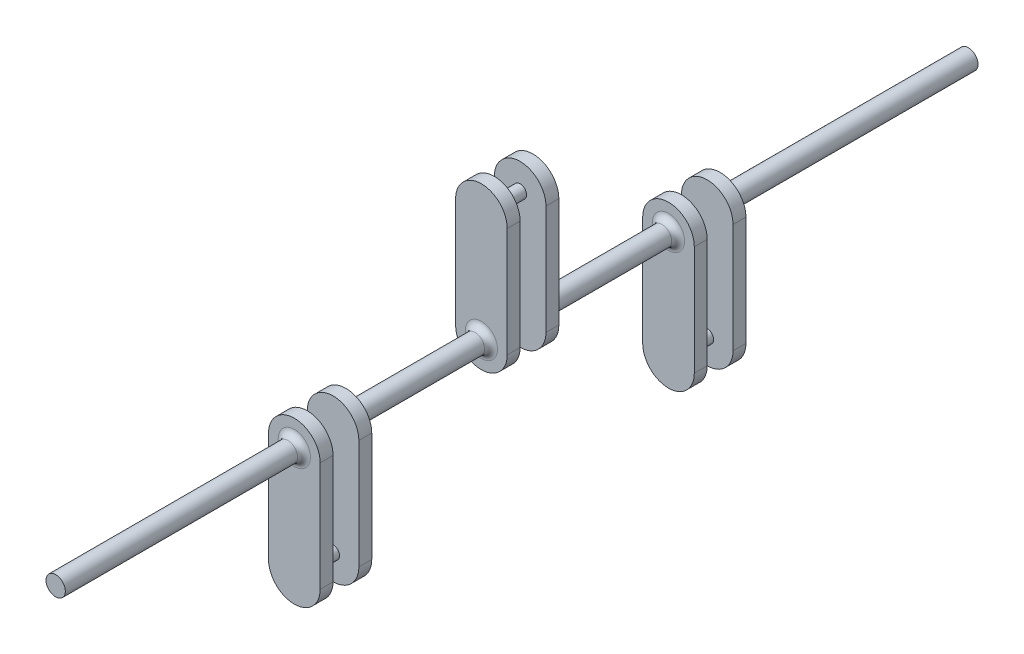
ISO-10303-21;
HEADER;
FILE_DESCRIPTION(('STEP AP214'),'2;1');
FILE_NAME('part.step','',(''),(''),'','','');
FILE_SCHEMA(('AUTOMOTIVE_DESIGN { 1 0 10303 214 1 1 1 1 }'));
ENDSEC;
DATA;
#1=APPLICATION_CONTEXT('core data for automotive mechanical design processes');
#2=APPLICATION_PROTOCOL_DEFINITION('international standard','automotive_design',2000,#1);
#3=PRODUCT_CONTEXT('',#1,'mechanical');
#4=PRODUCT('Part','Part','',(#3));
#5=PRODUCT_RELATED_PRODUCT_CATEGORY('part','',(#4));
#6=PRODUCT_DEFINITION_FORMATION('','',#4);
#7=PRODUCT_DEFINITION_CONTEXT('part definition',#1,'design');
#8=PRODUCT_DEFINITION('design','',#6,#7);
#9=PRODUCT_DEFINITION_SHAPE('','',#8);
#10=(LENGTH_UNIT() NAMED_UNIT(*) SI_UNIT(.MILLI.,.METRE.));
#11=(NAMED_UNIT(*) PLANE_ANGLE_UNIT() SI_UNIT($,.RADIAN.));
#12=(NAMED_UNIT(*) SI_UNIT($,.STERADIAN.) SOLID_ANGLE_UNIT());
#13=UNCERTAINTY_MEASURE_WITH_UNIT(LENGTH_MEASURE(1.E-05),#10,'distance_accuracy_value','');
#14=(GEOMETRIC_REPRESENTATION_CONTEXT(3) GLOBAL_UNCERTAINTY_ASSIGNED_CONTEXT((#13)) GLOBAL_UNIT_ASSIGNED_CONTEXT((#10,
#11,#12)) REPRESENTATION_CONTEXT('',''));
#15=CARTESIAN_POINT('',(0.,0.,0.));
#16=DIRECTION('',(0.,0.,1.));
#17=DIRECTION('',(1.,0.,0.));
#18=AXIS2_PLACEMENT_3D('',#15,#16,#17);
#19=CARTESIAN_POINT('',(-25.4,-1.76662079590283E-13,342.9));
#20=DIRECTION('',(1.,0.,0.));
#21=DIRECTION('',(0.,1.,0.));
#22=AXIS2_PLACEMENT_3D('',#19,#20,#21);
#23=PLANE('',#22);
#24=DIRECTION('',(0.,-1.,0.));
#25=VECTOR('',#24,1.);
#26=CARTESIAN_POINT('',(-25.4,-1.76662079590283E-13,330.2));
#27=LINE('',#26,#25);
#28=CARTESIAN_POINT('',(-25.4000000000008,107.7468,330.2));
#29=VERTEX_POINT('',#28);
#30=CARTESIAN_POINT('',(-25.4,-1.77367247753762E-13,330.2));
#31=VERTEX_POINT('',#30);
#32=EDGE_CURVE('E223',#29,#31,#27,.T.);
#33=ORIENTED_EDGE('',*,*,#32,.T.);
#34=DIRECTION('',(0.,0.,-1.));
#35=VECTOR('',#34,1.);
#36=CARTESIAN_POINT('',(-25.4,-1.77367247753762E-13,342.9));
#37=LINE('',#36,#35);
#38=CARTESIAN_POINT('',(-25.4,-1.77367247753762E-13,342.9));
#39=VERTEX_POINT('',#38);
#40=EDGE_CURVE('E286',#39,#31,#37,.T.);
#41=ORIENTED_EDGE('',*,*,#40,.F.);
#42=DIRECTION('',(0.,-1.,0.));
#43=VECTOR('',#42,1.);
#44=CARTESIAN_POINT('',(-25.4,-1.76662079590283E-13,342.9));
#45=LINE('',#44,#43);
#46=CARTESIAN_POINT('',(-25.4000000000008,107.7468,342.9));
#47=VERTEX_POINT('',#46);
#48=EDGE_CURVE('E259',#47,#39,#45,.T.);
#49=ORIENTED_EDGE('',*,*,#48,.F.);
#50=DIRECTION('',(0.,0.,-1.));
#51=VECTOR('',#50,1.);
#52=CARTESIAN_POINT('',(-25.4000000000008,107.7468,342.9));
#53=LINE('',#52,#51);
#54=EDGE_CURVE('E270',#47,#29,#53,.T.);
#55=ORIENTED_EDGE('',*,*,#54,.T.);
#56=EDGE_LOOP('',(#33,#41,#49,#55));
#57=FACE_BOUND('',#56,.T.);
#58=ADVANCED_FACE('F41',(#57),#23,.F.);
#59=CARTESIAN_POINT('',(0.,0.,342.9));
#60=DIRECTION('',(0.,0.,-1.));
#61=DIRECTION('',(-1.,0.,0.));
#62=AXIS2_PLACEMENT_3D('',#59,#60,#61);
#63=CYLINDRICAL_SURFACE('',#62,25.4);
#64=CARTESIAN_POINT('',(0.,0.,330.2));
#65=DIRECTION('',(0.,0.,1.));
#66=DIRECTION('',(1.,0.,0.));
#67=AXIS2_PLACEMENT_3D('',#64,#65,#66);
#68=CIRCLE('',#67,25.4);
#69=CARTESIAN_POINT('',(25.4,1.77367248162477E-13,330.2));
#70=VERTEX_POINT('',#69);
#71=EDGE_CURVE('E273',#31,#70,#68,.T.);
#72=ORIENTED_EDGE('',*,*,#71,.T.);
#73=DIRECTION('',(0.,0.,-1.));
#74=VECTOR('',#73,1.);
#75=CARTESIAN_POINT('',(25.4,1.77367248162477E-13,342.9));
#76=LINE('',#75,#74);
#77=CARTESIAN_POINT('',(25.4,1.77367248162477E-13,342.9));
#78=VERTEX_POINT('',#77);
#79=EDGE_CURVE('E284',#78,#70,#76,.T.);
#80=ORIENTED_EDGE('',*,*,#79,.F.);
#81=CARTESIAN_POINT('',(0.,0.,342.9));
#82=DIRECTION('',(0.,0.,1.));
#83=DIRECTION('',(1.,0.,0.));
#84=AXIS2_PLACEMENT_3D('',#81,#82,#83);
#85=CIRCLE('',#84,25.4);
#86=EDGE_CURVE('E262',#39,#78,#85,.T.);
#87=ORIENTED_EDGE('',*,*,#86,.F.);
#88=ORIENTED_EDGE('',*,*,#40,.T.);
#89=EDGE_LOOP('',(#72,#80,#87,#88));
#90=FACE_BOUND('',#89,.T.);
#91=ADVANCED_FACE('F476',(#90),#63,.T.);
#92=CARTESIAN_POINT('',(25.4,1.78297839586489E-13,342.9));
#93=DIRECTION('',(1.,0.,0.));
#94=DIRECTION('',(0.,1.,0.));
#95=AXIS2_PLACEMENT_3D('',#92,#93,#94);
#96=PLANE('',#95);
#97=DIRECTION('',(0.,-1.,0.));
#98=VECTOR('',#97,1.);
#99=CARTESIAN_POINT('',(25.4,1.78297839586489E-13,330.2));
#100=LINE('',#99,#98);
#101=CARTESIAN_POINT('',(25.3999999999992,107.7468,330.2));
#102=VERTEX_POINT('',#101);
#103=EDGE_CURVE('E276',#102,#70,#100,.T.);
#104=ORIENTED_EDGE('',*,*,#103,.F.);
#105=DIRECTION('',(0.,0.,-1.));
#106=VECTOR('',#105,1.);
#107=CARTESIAN_POINT('',(25.3999999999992,107.7468,342.9));
#108=LINE('',#107,#106);
#109=CARTESIAN_POINT('',(25.3999999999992,107.7468,342.9));
#110=VERTEX_POINT('',#109);
#111=EDGE_CURVE('E282',#110,#102,#108,.T.);
#112=ORIENTED_EDGE('',*,*,#111,.F.);
#113=DIRECTION('',(0.,-1.,0.));
#114=VECTOR('',#113,1.);
#115=CARTESIAN_POINT('',(25.4,1.78297839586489E-13,342.9));
#116=LINE('',#115,#114);
#117=EDGE_CURVE('E265',#110,#78,#116,.T.);
#118=ORIENTED_EDGE('',*,*,#117,.T.);
#119=ORIENTED_EDGE('',*,*,#79,.T.);
#120=EDGE_LOOP('',(#104,#112,#118,#119));
#121=FACE_BOUND('',#120,.T.);
#122=ADVANCED_FACE('F483',(#121),#96,.T.);
#123=CARTESIAN_POINT('',(-7.52391883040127E-13,107.7468,342.9));
#124=DIRECTION('',(0.,0.,-1.));
#125=DIRECTION('',(-1.,0.,0.));
#126=AXIS2_PLACEMENT_3D('',#123,#124,#125);
#127=CYLINDRICAL_SURFACE('',#126,25.4);
#128=CARTESIAN_POINT('',(-7.52391883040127E-13,107.7468,330.2));
#129=DIRECTION('',(0.,0.,1.));
#130=DIRECTION('',(1.,0.,0.));
#131=AXIS2_PLACEMENT_3D('',#128,#129,#130);
#132=CIRCLE('',#131,25.4);
#133=EDGE_CURVE('E263',#102,#29,#132,.T.);
#134=ORIENTED_EDGE('',*,*,#133,.T.);
#135=ORIENTED_EDGE('',*,*,#54,.F.);
#136=CARTESIAN_POINT('',(-7.52391883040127E-13,107.7468,342.9));
#137=DIRECTION('',(0.,0.,1.));
#138=DIRECTION('',(1.,0.,0.));
#139=AXIS2_PLACEMENT_3D('',#136,#137,#138);
#140=CIRCLE('',#139,25.4);
#141=EDGE_CURVE('E268',#110,#47,#140,.T.);
#142=ORIENTED_EDGE('',*,*,#141,.F.);
#143=ORIENTED_EDGE('',*,*,#111,.T.);
#144=EDGE_LOOP('',(#134,#135,#142,#143));
#145=FACE_BOUND('',#144,.T.);
#146=ADVANCED_FACE('F659',(#145),#127,.T.);
#147=CARTESIAN_POINT('',(0.,0.,342.9));
#148=DIRECTION('',(0.,0.,1.));
#149=DIRECTION('',(1.,0.,0.));
#150=AXIS2_PLACEMENT_3D('',#147,#148,#149);
#151=PLANE('',#150);
#152=CARTESIAN_POINT('',(0.,0.,342.9));
#153=DIRECTION('',(0.,0.,1.));
#154=DIRECTION('',(1.,0.,0.));
#155=AXIS2_PLACEMENT_3D('',#152,#153,#154);
#156=CIRCLE('',#155,15.875);
#157=CARTESIAN_POINT('',(15.875,0.,342.9));
#158=VERTEX_POINT('',#157);
#159=EDGE_CURVE('E453',#158,#158,#156,.F.);
#160=ORIENTED_EDGE('',*,*,#159,.T.);
#161=EDGE_LOOP('',(#160));
#162=FACE_BOUND('',#161,.T.);
#163=ORIENTED_EDGE('',*,*,#48,.T.);
#164=ORIENTED_EDGE('',*,*,#86,.T.);
#165=ORIENTED_EDGE('',*,*,#117,.F.);
#166=ORIENTED_EDGE('',*,*,#141,.T.);
#167=EDGE_LOOP('',(#163,#164,#165,#166));
#168=FACE_BOUND('',#167,.T.);
#169=ADVANCED_FACE('F656',(#162,#168),#151,.T.);
#170=CARTESIAN_POINT('',(0.,0.,330.2));
#171=DIRECTION('',(0.,0.,1.));
#172=DIRECTION('',(1.,0.,0.));
#173=AXIS2_PLACEMENT_3D('',#170,#171,#172);
#174=PLANE('',#173);
#175=CARTESIAN_POINT('',(-7.52391883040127E-13,107.7468,330.2));
#176=DIRECTION('',(0.,0.,1.));
#177=DIRECTION('',(1.,0.,0.));
#178=AXIS2_PLACEMENT_3D('',#175,#176,#177);
#179=CIRCLE('',#178,6.35000000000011);
#180=CARTESIAN_POINT('',(6.34999999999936,107.7468,330.2));
#181=VERTEX_POINT('',#180);
#182=EDGE_CURVE('E246',#181,#181,#179,.T.);
#183=ORIENTED_EDGE('',*,*,#182,.T.);
#184=EDGE_LOOP('',(#183));
#185=FACE_BOUND('',#184,.T.);
#186=ORIENTED_EDGE('',*,*,#32,.F.);
#187=ORIENTED_EDGE('',*,*,#133,.F.);
#188=ORIENTED_EDGE('',*,*,#103,.T.);
#189=ORIENTED_EDGE('',*,*,#71,.F.);
#190=EDGE_LOOP('',(#186,#187,#188,#189));
#191=FACE_BOUND('',#190,.T.);
#192=ADVANCED_FACE('F594',(#185,#191),#174,.F.);
#193=CARTESIAN_POINT('',(0.,0.,762.));
#194=DIRECTION('',(0.,0.,1.));
#195=DIRECTION('',(1.,0.,0.));
#196=AXIS2_PLACEMENT_3D('',#193,#194,#195);
#197=PLANE('',#196);
#198=CARTESIAN_POINT('',(0.,0.,762.));
#199=DIRECTION('',(0.,0.,1.));
#200=DIRECTION('',(1.,0.,0.));
#201=AXIS2_PLACEMENT_3D('',#198,#199,#200);
#202=CIRCLE('',#201,9.525);
#203=CARTESIAN_POINT('',(9.525,0.,762.));
#204=VERTEX_POINT('',#203);
#205=EDGE_CURVE('E419',#204,#204,#202,.T.);
#206=ORIENTED_EDGE('',*,*,#205,.T.);
#207=EDGE_LOOP('',(#206));
#208=FACE_BOUND('',#207,.T.);
#209=ADVANCED_FACE('F591',(#208),#197,.T.);
#210=CARTESIAN_POINT('',(0.,0.,762.));
#211=DIRECTION('',(0.,0.,-1.));
#212=DIRECTION('',(-1.,0.,0.));
#213=AXIS2_PLACEMENT_3D('',#210,#211,#212);
#214=CYLINDRICAL_SURFACE('',#213,9.525);
#215=CARTESIAN_POINT('',(0.,0.,533.4));
#216=DIRECTION('',(0.,0.,1.));
#217=DIRECTION('',(1.,0.,0.));
#218=AXIS2_PLACEMENT_3D('',#215,#216,#217);
#219=CIRCLE('',#218,9.525);
#220=CARTESIAN_POINT('',(9.525,0.,533.4));
#221=VERTEX_POINT('',#220);
#222=EDGE_CURVE('E438',#221,#221,#219,.T.);
#223=ORIENTED_EDGE('',*,*,#222,.T.);
#224=EDGE_LOOP('',(#223));
#225=FACE_BOUND('',#224,.T.);
#226=ORIENTED_EDGE('',*,*,#205,.F.);
#227=EDGE_LOOP('',(#226));
#228=FACE_BOUND('',#227,.T.);
#229=ADVANCED_FACE('F507',(#225,#228),#214,.T.);
#230=CARTESIAN_POINT('',(0.,-107.7468,527.05));
#231=DIRECTION('',(0.,0.,1.));
#232=DIRECTION('',(-1.,0.,0.));
#233=AXIS2_PLACEMENT_3D('',#230,#231,#232);
#234=PLANE('',#233);
#235=CARTESIAN_POINT('',(0.,0.,527.05));
#236=DIRECTION('',(0.,0.,1.));
#237=DIRECTION('',(1.,0.,0.));
#238=AXIS2_PLACEMENT_3D('',#235,#236,#237);
#239=CIRCLE('',#238,15.875);
#240=CARTESIAN_POINT('',(15.875,0.,527.05));
#241=VERTEX_POINT('',#240);
#242=EDGE_CURVE('E441',#241,#241,#239,.F.);
#243=ORIENTED_EDGE('',*,*,#242,.T.);
#244=EDGE_LOOP('',(#243));
#245=FACE_BOUND('',#244,.T.);
#246=CARTESIAN_POINT('',(0.,-107.7468,527.05));
#247=DIRECTION('',(0.,0.,-1.));
#248=DIRECTION('',(-1.,0.,0.));
#249=AXIS2_PLACEMENT_3D('',#246,#247,#248);
#250=CIRCLE('',#249,25.4);
#251=CARTESIAN_POINT('',(25.4,-107.7468,527.05));
#252=VERTEX_POINT('',#251);
#253=CARTESIAN_POINT('',(-25.4,-107.7468,527.05));
#254=VERTEX_POINT('',#253);
#255=EDGE_CURVE('E318',#252,#254,#250,.T.);
#256=ORIENTED_EDGE('',*,*,#255,.F.);
#257=DIRECTION('',(0.,-1.,0.));
#258=VECTOR('',#257,1.);
#259=CARTESIAN_POINT('',(25.4,-107.7468,527.05));
#260=LINE('',#259,#258);
#261=CARTESIAN_POINT('',(25.4,0.,527.05));
#262=VERTEX_POINT('',#261);
#263=EDGE_CURVE('E289',#262,#252,#260,.T.);
#264=ORIENTED_EDGE('',*,*,#263,.F.);
#265=CARTESIAN_POINT('',(0.,0.,527.05));
#266=DIRECTION('',(0.,0.,-1.));
#267=DIRECTION('',(-1.,0.,0.));
#268=AXIS2_PLACEMENT_3D('',#265,#266,#267);
#269=CIRCLE('',#268,25.4);
#270=CARTESIAN_POINT('',(-25.4,0.,527.05));
#271=VERTEX_POINT('',#270);
#272=EDGE_CURVE('E300',#271,#262,#269,.T.);
#273=ORIENTED_EDGE('',*,*,#272,.F.);
#274=DIRECTION('',(0.,1.,0.));
#275=VECTOR('',#274,1.);
#276=CARTESIAN_POINT('',(-25.4,-107.7468,527.05));
#277=LINE('',#276,#275);
#278=EDGE_CURVE('E309',#254,#271,#277,.T.);
#279=ORIENTED_EDGE('',*,*,#278,.F.);
#280=EDGE_LOOP('',(#256,#264,#273,#279));
#281=FACE_BOUND('',#280,.T.);
#282=ADVANCED_FACE('F491',(#245,#281),#234,.T.);
#283=CARTESIAN_POINT('',(25.4,-107.7468,514.35));
#284=DIRECTION('',(-1.,0.,0.));
#285=DIRECTION('',(0.,0.,1.));
#286=AXIS2_PLACEMENT_3D('',#283,#284,#285);
#287=PLANE('',#286);
#288=ORIENTED_EDGE('',*,*,#263,.T.);
#289=DIRECTION('',(0.,0.,1.));
#290=VECTOR('',#289,1.);
#291=CARTESIAN_POINT('',(25.4,-107.7468,514.35));
#292=LINE('',#291,#290);
#293=CARTESIAN_POINT('',(25.4,-107.7468,514.35));
#294=VERTEX_POINT('',#293);
#295=EDGE_CURVE('E291',#294,#252,#292,.T.);
#296=ORIENTED_EDGE('',*,*,#295,.F.);
#297=DIRECTION('',(0.,-1.,0.));
#298=VECTOR('',#297,1.);
#299=CARTESIAN_POINT('',(25.4,-107.7468,514.35));
#300=LINE('',#299,#298);
#301=CARTESIAN_POINT('',(25.4,0.,514.35));
#302=VERTEX_POINT('',#301);
#303=EDGE_CURVE('E294',#302,#294,#300,.T.);
#304=ORIENTED_EDGE('',*,*,#303,.F.);
#305=DIRECTION('',(0.,0.,1.));
#306=VECTOR('',#305,1.);
#307=CARTESIAN_POINT('',(25.4,0.,514.35));
#308=LINE('',#307,#306);
#309=EDGE_CURVE('E297',#302,#262,#308,.T.);
#310=ORIENTED_EDGE('',*,*,#309,.T.);
#311=EDGE_LOOP('',(#288,#296,#304,#310));
#312=FACE_BOUND('',#311,.T.);
#313=ADVANCED_FACE('F488',(#312),#287,.F.);
#314=CARTESIAN_POINT('',(0.,0.,514.35));
#315=DIRECTION('',(0.,0.,1.));
#316=DIRECTION('',(1.,0.,0.));
#317=AXIS2_PLACEMENT_3D('',#314,#315,#316);
#318=CYLINDRICAL_SURFACE('',#317,25.4);
#319=ORIENTED_EDGE('',*,*,#272,.T.);
#320=ORIENTED_EDGE('',*,*,#309,.F.);
#321=CARTESIAN_POINT('',(0.,0.,514.35));
#322=DIRECTION('',(0.,0.,-1.));
#323=DIRECTION('',(-1.,0.,0.));
#324=AXIS2_PLACEMENT_3D('',#321,#322,#323);
#325=CIRCLE('',#324,25.4);
#326=CARTESIAN_POINT('',(-25.4,0.,514.35));
#327=VERTEX_POINT('',#326);
#328=EDGE_CURVE('E303',#327,#302,#325,.T.);
#329=ORIENTED_EDGE('',*,*,#328,.F.);
#330=DIRECTION('',(0.,0.,1.));
#331=VECTOR('',#330,1.);
#332=CARTESIAN_POINT('',(-25.4,0.,514.35));
#333=LINE('',#332,#331);
#334=EDGE_CURVE('E306',#327,#271,#333,.T.);
#335=ORIENTED_EDGE('',*,*,#334,.T.);
#336=EDGE_LOOP('',(#319,#320,#329,#335));
#337=FACE_BOUND('',#336,.T.);
#338=ADVANCED_FACE('F490',(#337),#318,.T.);
#339=CARTESIAN_POINT('',(-25.4,-107.7468,514.35));
#340=DIRECTION('',(1.,0.,0.));
#341=DIRECTION('',(0.,0.,-1.));
#342=AXIS2_PLACEMENT_3D('',#339,#340,#341);
#343=PLANE('',#342);
#344=ORIENTED_EDGE('',*,*,#278,.T.);
#345=ORIENTED_EDGE('',*,*,#334,.F.);
#346=DIRECTION('',(0.,1.,0.));
#347=VECTOR('',#346,1.);
#348=CARTESIAN_POINT('',(-25.4,-107.7468,514.35));
#349=LINE('',#348,#347);
#350=CARTESIAN_POINT('',(-25.4,-107.7468,514.35));
#351=VERTEX_POINT('',#350);
#352=EDGE_CURVE('E312',#351,#327,#349,.T.);
#353=ORIENTED_EDGE('',*,*,#352,.F.);
#354=DIRECTION('',(0.,0.,1.));
#355=VECTOR('',#354,1.);
#356=CARTESIAN_POINT('',(-25.4,-107.7468,514.35));
#357=LINE('',#356,#355);
#358=EDGE_CURVE('E315',#351,#254,#357,.T.);
#359=ORIENTED_EDGE('',*,*,#358,.T.);
#360=EDGE_LOOP('',(#344,#345,#353,#359));
#361=FACE_BOUND('',#360,.T.);
#362=ADVANCED_FACE('F495',(#361),#343,.F.);
#363=CARTESIAN_POINT('',(0.,-107.7468,514.35));
#364=DIRECTION('',(0.,0.,1.));
#365=DIRECTION('',(1.,0.,0.));
#366=AXIS2_PLACEMENT_3D('',#363,#364,#365);
#367=CYLINDRICAL_SURFACE('',#366,25.4);
#368=ORIENTED_EDGE('',*,*,#255,.T.);
#369=ORIENTED_EDGE('',*,*,#358,.F.);
#370=CARTESIAN_POINT('',(0.,-107.7468,514.35));
#371=DIRECTION('',(0.,0.,-1.));
#372=DIRECTION('',(-1.,0.,0.));
#373=AXIS2_PLACEMENT_3D('',#370,#371,#372);
#374=CIRCLE('',#373,25.4);
#375=EDGE_CURVE('E321',#294,#351,#374,.T.);
#376=ORIENTED_EDGE('',*,*,#375,.F.);
#377=ORIENTED_EDGE('',*,*,#295,.T.);
#378=EDGE_LOOP('',(#368,#369,#376,#377));
#379=FACE_BOUND('',#378,.T.);
#380=ADVANCED_FACE('F499',(#379),#367,.T.);
#381=CARTESIAN_POINT('',(0.,-107.7468,514.35));
#382=DIRECTION('',(0.,0.,1.));
#383=DIRECTION('',(-1.,0.,0.));
#384=AXIS2_PLACEMENT_3D('',#381,#382,#383);
#385=PLANE('',#384);
#386=ORIENTED_EDGE('',*,*,#375,.T.);
#387=ORIENTED_EDGE('',*,*,#352,.T.);
#388=ORIENTED_EDGE('',*,*,#328,.T.);
#389=ORIENTED_EDGE('',*,*,#303,.T.);
#390=EDGE_LOOP('',(#386,#387,#388,#389));
#391=FACE_BOUND('',#390,.T.);
#392=CARTESIAN_POINT('',(0.,-107.7468,514.35));
#393=DIRECTION('',(0.,0.,-1.));
#394=DIRECTION('',(-1.,0.,0.));
#395=AXIS2_PLACEMENT_3D('',#392,#393,#394);
#396=CIRCLE('',#395,6.35);
#397=CARTESIAN_POINT('',(-6.35,-107.7468,514.35));
#398=VERTEX_POINT('',#397);
#399=EDGE_CURVE('E324',#398,#398,#396,.T.);
#400=ORIENTED_EDGE('',*,*,#399,.F.);
#401=EDGE_LOOP('',(#400));
#402=FACE_BOUND('',#401,.T.);
#403=ADVANCED_FACE('F503',(#391,#402),#385,.F.);
#404=CARTESIAN_POINT('',(0.,-107.7468,545.010512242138));
#405=DIRECTION('',(0.,0.,-1.));
#406=DIRECTION('',(-1.,0.,0.));
#407=AXIS2_PLACEMENT_3D('',#404,#405,#406);
#408=CYLINDRICAL_SURFACE('',#407,6.35);
#409=ORIENTED_EDGE('',*,*,#399,.T.);
#410=EDGE_LOOP('',(#409));
#411=FACE_BOUND('',#410,.T.);
#412=CARTESIAN_POINT('',(0.,-107.7468,488.95));
#413=DIRECTION('',(0.,0.,-1.));
#414=DIRECTION('',(-1.,0.,0.));
#415=AXIS2_PLACEMENT_3D('',#412,#413,#414);
#416=CIRCLE('',#415,6.35);
#417=CARTESIAN_POINT('',(-6.35,-107.7468,488.95));
#418=VERTEX_POINT('',#417);
#419=EDGE_CURVE('E327',#418,#418,#416,.T.);
#420=ORIENTED_EDGE('',*,*,#419,.F.);
#421=EDGE_LOOP('',(#420));
#422=FACE_BOUND('',#421,.T.);
#423=ADVANCED_FACE('F511',(#411,#422),#408,.T.);
#424=CARTESIAN_POINT('',(0.,-107.7468,488.95));
#425=DIRECTION('',(0.,0.,-1.));
#426=DIRECTION('',(-1.,0.,0.));
#427=AXIS2_PLACEMENT_3D('',#424,#425,#426);
#428=PLANE('',#427);
#429=ORIENTED_EDGE('',*,*,#419,.T.);
#430=EDGE_LOOP('',(#429));
#431=FACE_BOUND('',#430,.T.);
#432=CARTESIAN_POINT('',(0.,-107.7468,488.95));
#433=DIRECTION('',(0.,0.,-1.));
#434=DIRECTION('',(-1.,0.,0.));
#435=AXIS2_PLACEMENT_3D('',#432,#433,#434);
#436=CIRCLE('',#435,25.4);
#437=CARTESIAN_POINT('',(25.4,-107.7468,488.95));
#438=VERTEX_POINT('',#437);
#439=CARTESIAN_POINT('',(-25.4,-107.7468,488.95));
#440=VERTEX_POINT('',#439);
#441=EDGE_CURVE('E330',#438,#440,#436,.T.);
#442=ORIENTED_EDGE('',*,*,#441,.F.);
#443=DIRECTION('',(0.,-1.,0.));
#444=VECTOR('',#443,1.);
#445=CARTESIAN_POINT('',(25.4,-107.7468,488.95));
#446=LINE('',#445,#444);
#447=CARTESIAN_POINT('',(25.4,0.,488.95));
#448=VERTEX_POINT('',#447);
#449=EDGE_CURVE('E332',#448,#438,#446,.T.);
#450=ORIENTED_EDGE('',*,*,#449,.F.);
#451=CARTESIAN_POINT('',(0.,0.,488.95));
#452=DIRECTION('',(0.,0.,-1.));
#453=DIRECTION('',(-1.,0.,0.));
#454=AXIS2_PLACEMENT_3D('',#451,#452,#453);
#455=CIRCLE('',#454,25.4);
#456=CARTESIAN_POINT('',(-25.4,0.,488.95));
#457=VERTEX_POINT('',#456);
#458=EDGE_CURVE('E335',#457,#448,#455,.T.);
#459=ORIENTED_EDGE('',*,*,#458,.F.);
#460=DIRECTION('',(0.,1.,0.));
#461=VECTOR('',#460,1.);
#462=CARTESIAN_POINT('',(-25.4,-107.7468,488.95));
#463=LINE('',#462,#461);
#464=EDGE_CURVE('E338',#440,#457,#463,.T.);
#465=ORIENTED_EDGE('',*,*,#464,.F.);
#466=EDGE_LOOP('',(#442,#450,#459,#465));
#467=FACE_BOUND('',#466,.T.);
#468=ADVANCED_FACE('F515',(#431,#467),#428,.F.);
#469=CARTESIAN_POINT('',(25.4,-107.7468,488.95));
#470=DIRECTION('',(1.,0.,0.));
#471=DIRECTION('',(0.,0.,-1.));
#472=AXIS2_PLACEMENT_3D('',#469,#470,#471);
#473=PLANE('',#472);
#474=DIRECTION('',(0.,-1.,0.));
#475=VECTOR('',#474,1.);
#476=CARTESIAN_POINT('',(25.4,-107.7468,476.25));
#477=LINE('',#476,#475);
#478=CARTESIAN_POINT('',(25.4,0.,476.25));
#479=VERTEX_POINT('',#478);
#480=CARTESIAN_POINT('',(25.4,-107.7468,476.25));
#481=VERTEX_POINT('',#480);
#482=EDGE_CURVE('E354',#479,#481,#477,.T.);
#483=ORIENTED_EDGE('',*,*,#482,.F.);
#484=DIRECTION('',(0.,0.,-1.));
#485=VECTOR('',#484,1.);
#486=CARTESIAN_POINT('',(25.4,0.,488.95));
#487=LINE('',#486,#485);
#488=EDGE_CURVE('E357',#448,#479,#487,.T.);
#489=ORIENTED_EDGE('',*,*,#488,.F.);
#490=ORIENTED_EDGE('',*,*,#449,.T.);
#491=DIRECTION('',(0.,0.,-1.));
#492=VECTOR('',#491,1.);
#493=CARTESIAN_POINT('',(25.4,-107.7468,488.95));
#494=LINE('',#493,#492);
#495=EDGE_CURVE('E360',#438,#481,#494,.T.);
#496=ORIENTED_EDGE('',*,*,#495,.T.);
#497=EDGE_LOOP('',(#483,#489,#490,#496));
#498=FACE_BOUND('',#497,.T.);
#499=ADVANCED_FACE('F519',(#498),#473,.T.);
#500=CARTESIAN_POINT('',(0.,0.,488.95));
#501=DIRECTION('',(0.,0.,-1.));
#502=DIRECTION('',(-1.,0.,0.));
#503=AXIS2_PLACEMENT_3D('',#500,#501,#502);
#504=CYLINDRICAL_SURFACE('',#503,25.4);
#505=CARTESIAN_POINT('',(0.,0.,476.25));
#506=DIRECTION('',(0.,0.,-1.));
#507=DIRECTION('',(-1.,0.,0.));
#508=AXIS2_PLACEMENT_3D('',#505,#506,#507);
#509=CIRCLE('',#508,25.4);
#510=CARTESIAN_POINT('',(-25.4,0.,476.25));
#511=VERTEX_POINT('',#510);
#512=EDGE_CURVE('E352',#511,#479,#509,.T.);
#513=ORIENTED_EDGE('',*,*,#512,.F.);
#514=DIRECTION('',(0.,0.,-1.));
#515=VECTOR('',#514,1.);
#516=CARTESIAN_POINT('',(-25.4,0.,488.95));
#517=LINE('',#516,#515);
#518=EDGE_CURVE('E346',#457,#511,#517,.T.);
#519=ORIENTED_EDGE('',*,*,#518,.F.);
#520=ORIENTED_EDGE('',*,*,#458,.T.);
#521=ORIENTED_EDGE('',*,*,#488,.T.);
#522=EDGE_LOOP('',(#513,#519,#520,#521));
#523=FACE_BOUND('',#522,.T.);
#524=ADVANCED_FACE('F525',(#523),#504,.T.);
#525=CARTESIAN_POINT('',(-25.4,-107.7468,488.95));
#526=DIRECTION('',(-1.,0.,0.));
#527=DIRECTION('',(0.,0.,1.));
#528=AXIS2_PLACEMENT_3D('',#525,#526,#527);
#529=PLANE('',#528);
#530=DIRECTION('',(0.,1.,0.));
#531=VECTOR('',#530,1.);
#532=CARTESIAN_POINT('',(-25.4,-107.7468,476.25));
#533=LINE('',#532,#531);
#534=CARTESIAN_POINT('',(-25.4,-107.7468,476.25));
#535=VERTEX_POINT('',#534);
#536=EDGE_CURVE('E341',#535,#511,#533,.T.);
#537=ORIENTED_EDGE('',*,*,#536,.F.);
#538=DIRECTION('',(0.,0.,-1.));
#539=VECTOR('',#538,1.);
#540=CARTESIAN_POINT('',(-25.4,-107.7468,488.95));
#541=LINE('',#540,#539);
#542=EDGE_CURVE('E343',#440,#535,#541,.T.);
#543=ORIENTED_EDGE('',*,*,#542,.F.);
#544=ORIENTED_EDGE('',*,*,#464,.T.);
#545=ORIENTED_EDGE('',*,*,#518,.T.);
#546=EDGE_LOOP('',(#537,#543,#544,#545));
#547=FACE_BOUND('',#546,.T.);
#548=ADVANCED_FACE('F521',(#547),#529,.T.);
#549=CARTESIAN_POINT('',(0.,-107.7468,488.95));
#550=DIRECTION('',(0.,0.,-1.));
#551=DIRECTION('',(-1.,0.,0.));
#552=AXIS2_PLACEMENT_3D('',#549,#550,#551);
#553=CYLINDRICAL_SURFACE('',#552,25.4);
#554=CARTESIAN_POINT('',(0.,-107.7468,476.25));
#555=DIRECTION('',(0.,0.,-1.));
#556=DIRECTION('',(-1.,0.,0.));
#557=AXIS2_PLACEMENT_3D('',#554,#555,#556);
#558=CIRCLE('',#557,25.4);
#559=EDGE_CURVE('E349',#481,#535,#558,.T.);
#560=ORIENTED_EDGE('',*,*,#559,.F.);
#561=ORIENTED_EDGE('',*,*,#495,.F.);
#562=ORIENTED_EDGE('',*,*,#441,.T.);
#563=ORIENTED_EDGE('',*,*,#542,.T.);
#564=EDGE_LOOP('',(#560,#561,#562,#563));
#565=FACE_BOUND('',#564,.T.);
#566=ADVANCED_FACE('F524',(#565),#553,.T.);
#567=CARTESIAN_POINT('',(0.,-107.7468,476.25));
#568=DIRECTION('',(0.,0.,-1.));
#569=DIRECTION('',(-1.,0.,0.));
#570=AXIS2_PLACEMENT_3D('',#567,#568,#569);
#571=PLANE('',#570);
#572=CARTESIAN_POINT('',(0.,0.,476.25));
#573=DIRECTION('',(0.,0.,-1.));
#574=DIRECTION('',(-1.,0.,0.));
#575=AXIS2_PLACEMENT_3D('',#572,#573,#574);
#576=CIRCLE('',#575,15.875);
#577=CARTESIAN_POINT('',(-15.875,0.,476.25));
#578=VERTEX_POINT('',#577);
#579=EDGE_CURVE('E450',#578,#578,#576,.F.);
#580=ORIENTED_EDGE('',*,*,#579,.T.);
#581=EDGE_LOOP('',(#580));
#582=FACE_BOUND('',#581,.T.);
#583=ORIENTED_EDGE('',*,*,#559,.T.);
#584=ORIENTED_EDGE('',*,*,#536,.T.);
#585=ORIENTED_EDGE('',*,*,#512,.T.);
#586=ORIENTED_EDGE('',*,*,#482,.T.);
#587=EDGE_LOOP('',(#583,#584,#585,#586));
#588=FACE_BOUND('',#587,.T.);
#589=ADVANCED_FACE('F527',(#582,#588),#571,.T.);
#590=CARTESIAN_POINT('',(0.,0.,469.9));
#591=DIRECTION('',(0.,0.,-1.));
#592=DIRECTION('',(-1.,0.,0.));
#593=AXIS2_PLACEMENT_3D('',#590,#591,#592);
#594=CIRCLE('',#593,9.525);
#595=CARTESIAN_POINT('',(-9.525,0.,469.9));
#596=VERTEX_POINT('',#595);
#597=EDGE_CURVE('E447',#596,#596,#594,.T.);
#598=ORIENTED_EDGE('',*,*,#597,.T.);
#599=EDGE_LOOP('',(#598));
#600=FACE_BOUND('',#599,.T.);
#601=CARTESIAN_POINT('',(0.,0.,349.25));
#602=DIRECTION('',(0.,0.,1.));
#603=DIRECTION('',(1.,0.,0.));
#604=AXIS2_PLACEMENT_3D('',#601,#602,#603);
#605=CIRCLE('',#604,9.525);
#606=CARTESIAN_POINT('',(9.525,0.,349.25));
#607=VERTEX_POINT('',#606);
#608=EDGE_CURVE('E444',#607,#607,#605,.T.);
#609=ORIENTED_EDGE('',*,*,#608,.T.);
#610=EDGE_LOOP('',(#609));
#611=FACE_BOUND('',#610,.T.);
#612=ADVANCED_FACE('F530',(#600,#611),#214,.T.);
#613=CARTESIAN_POINT('',(-25.4,-1.76662079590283E-13,292.1));
#614=DIRECTION('',(-1.,0.,0.));
#615=DIRECTION('',(0.,-1.,0.));
#616=AXIS2_PLACEMENT_3D('',#613,#614,#615);
#617=PLANE('',#616);
#618=DIRECTION('',(0.,-1.,0.));
#619=VECTOR('',#618,1.);
#620=CARTESIAN_POINT('',(-25.4,-1.76662079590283E-13,304.8));
#621=LINE('',#620,#619);
#622=CARTESIAN_POINT('',(-25.4000000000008,107.7468,304.8));
#623=VERTEX_POINT('',#622);
#624=CARTESIAN_POINT('',(-25.4,-1.77367247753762E-13,304.8));
#625=VERTEX_POINT('',#624);
#626=EDGE_CURVE('E218',#623,#625,#621,.T.);
#627=ORIENTED_EDGE('',*,*,#626,.F.);
#628=DIRECTION('',(0.,0.,1.));
#629=VECTOR('',#628,1.);
#630=CARTESIAN_POINT('',(-25.4000000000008,107.7468,292.1));
#631=LINE('',#630,#629);
#632=CARTESIAN_POINT('',(-25.4000000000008,107.7468,292.1));
#633=VERTEX_POINT('',#632);
#634=EDGE_CURVE('E212',#633,#623,#631,.T.);
#635=ORIENTED_EDGE('',*,*,#634,.F.);
#636=DIRECTION('',(0.,-1.,0.));
#637=VECTOR('',#636,1.);
#638=CARTESIAN_POINT('',(-25.4,-1.76662079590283E-13,292.1));
#639=LINE('',#638,#637);
#640=CARTESIAN_POINT('',(-25.4,-1.77367247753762E-13,292.1));
#641=VERTEX_POINT('',#640);
#642=EDGE_CURVE('E215',#633,#641,#639,.T.);
#643=ORIENTED_EDGE('',*,*,#642,.T.);
#644=DIRECTION('',(0.,0.,1.));
#645=VECTOR('',#644,1.);
#646=CARTESIAN_POINT('',(-25.4,-1.77367247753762E-13,292.1));
#647=LINE('',#646,#645);
#648=EDGE_CURVE('E242',#641,#625,#647,.T.);
#649=ORIENTED_EDGE('',*,*,#648,.T.);
#650=EDGE_LOOP('',(#627,#635,#643,#649));
#651=FACE_BOUND('',#650,.T.);
#652=ADVANCED_FACE('F214',(#651),#617,.T.);
#653=CARTESIAN_POINT('',(-7.52391883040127E-13,107.7468,292.1));
#654=DIRECTION('',(0.,0.,1.));
#655=DIRECTION('',(1.,0.,0.));
#656=AXIS2_PLACEMENT_3D('',#653,#654,#655);
#657=CYLINDRICAL_SURFACE('',#656,25.4);
#658=CARTESIAN_POINT('',(-7.52391883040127E-13,107.7468,304.8));
#659=DIRECTION('',(0.,0.,1.));
#660=DIRECTION('',(1.,0.,0.));
#661=AXIS2_PLACEMENT_3D('',#658,#659,#660);
#662=CIRCLE('',#661,25.4);
#663=CARTESIAN_POINT('',(25.3999999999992,107.7468,304.8));
#664=VERTEX_POINT('',#663);
#665=EDGE_CURVE('E248',#664,#623,#662,.T.);
#666=ORIENTED_EDGE('',*,*,#665,.F.);
#667=DIRECTION('',(0.,0.,1.));
#668=VECTOR('',#667,1.);
#669=CARTESIAN_POINT('',(25.3999999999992,107.7468,292.1));
#670=LINE('',#669,#668);
#671=CARTESIAN_POINT('',(25.3999999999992,107.7468,292.1));
#672=VERTEX_POINT('',#671);
#673=EDGE_CURVE('E224',#672,#664,#670,.T.);
#674=ORIENTED_EDGE('',*,*,#673,.F.);
#675=CARTESIAN_POINT('',(-7.52391883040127E-13,107.7468,292.1));
#676=DIRECTION('',(0.,0.,1.));
#677=DIRECTION('',(1.,0.,0.));
#678=AXIS2_PLACEMENT_3D('',#675,#676,#677);
#679=CIRCLE('',#678,25.4);
#680=EDGE_CURVE('E229',#672,#633,#679,.T.);
#681=ORIENTED_EDGE('',*,*,#680,.T.);
#682=ORIENTED_EDGE('',*,*,#634,.T.);
#683=EDGE_LOOP('',(#666,#674,#681,#682));
#684=FACE_BOUND('',#683,.T.);
#685=ADVANCED_FACE('F234',(#684),#657,.T.);
#686=CARTESIAN_POINT('',(25.4,1.78297839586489E-13,292.1));
#687=DIRECTION('',(-1.,0.,0.));
#688=DIRECTION('',(0.,-1.,0.));
#689=AXIS2_PLACEMENT_3D('',#686,#687,#688);
#690=PLANE('',#689);
#691=DIRECTION('',(0.,-1.,0.));
#692=VECTOR('',#691,1.);
#693=CARTESIAN_POINT('',(25.4,1.78297839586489E-13,304.8));
#694=LINE('',#693,#692);
#695=CARTESIAN_POINT('',(25.4,1.77367248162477E-13,304.8));
#696=VERTEX_POINT('',#695);
#697=EDGE_CURVE('E250',#664,#696,#694,.T.);
#698=ORIENTED_EDGE('',*,*,#697,.T.);
#699=DIRECTION('',(0.,0.,1.));
#700=VECTOR('',#699,1.);
#701=CARTESIAN_POINT('',(25.4,1.77367248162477E-13,292.1));
#702=LINE('',#701,#700);
#703=CARTESIAN_POINT('',(25.4,1.77367248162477E-13,292.1));
#704=VERTEX_POINT('',#703);
#705=EDGE_CURVE('E256',#704,#696,#702,.T.);
#706=ORIENTED_EDGE('',*,*,#705,.F.);
#707=DIRECTION('',(0.,-1.,0.));
#708=VECTOR('',#707,1.);
#709=CARTESIAN_POINT('',(25.4,1.78297839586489E-13,292.1));
#710=LINE('',#709,#708);
#711=EDGE_CURVE('E236',#672,#704,#710,.T.);
#712=ORIENTED_EDGE('',*,*,#711,.F.);
#713=ORIENTED_EDGE('',*,*,#673,.T.);
#714=EDGE_LOOP('',(#698,#706,#712,#713));
#715=FACE_BOUND('',#714,.T.);
#716=ADVANCED_FACE('F649',(#715),#690,.F.);
#717=CARTESIAN_POINT('',(0.,0.,292.1));
#718=DIRECTION('',(0.,0.,1.));
#719=DIRECTION('',(1.,0.,0.));
#720=AXIS2_PLACEMENT_3D('',#717,#718,#719);
#721=CYLINDRICAL_SURFACE('',#720,25.4);
#722=CARTESIAN_POINT('',(0.,0.,304.8));
#723=DIRECTION('',(0.,0.,1.));
#724=DIRECTION('',(1.,0.,0.));
#725=AXIS2_PLACEMENT_3D('',#722,#723,#724);
#726=CIRCLE('',#725,25.4);
#727=EDGE_CURVE('E232',#625,#696,#726,.T.);
#728=ORIENTED_EDGE('',*,*,#727,.F.);
#729=ORIENTED_EDGE('',*,*,#648,.F.);
#730=CARTESIAN_POINT('',(0.,0.,292.1));
#731=DIRECTION('',(0.,0.,1.));
#732=DIRECTION('',(1.,0.,0.));
#733=AXIS2_PLACEMENT_3D('',#730,#731,#732);
#734=CIRCLE('',#733,25.4);
#735=EDGE_CURVE('E231',#641,#704,#734,.T.);
#736=ORIENTED_EDGE('',*,*,#735,.T.);
#737=ORIENTED_EDGE('',*,*,#705,.T.);
#738=EDGE_LOOP('',(#728,#729,#736,#737));
#739=FACE_BOUND('',#738,.T.);
#740=ADVANCED_FACE('F643',(#739),#721,.T.);
#741=CARTESIAN_POINT('',(0.,0.,292.1));
#742=DIRECTION('',(0.,0.,-1.));
#743=DIRECTION('',(1.,0.,0.));
#744=AXIS2_PLACEMENT_3D('',#741,#742,#743);
#745=PLANE('',#744);
#746=CARTESIAN_POINT('',(0.,0.,292.1));
#747=DIRECTION('',(0.,0.,-1.));
#748=DIRECTION('',(-1.,0.,0.));
#749=AXIS2_PLACEMENT_3D('',#746,#747,#748);
#750=CIRCLE('',#749,15.875);
#751=CARTESIAN_POINT('',(-15.875,0.,292.1));
#752=VERTEX_POINT('',#751);
#753=EDGE_CURVE('E11',#752,#752,#750,.F.);
#754=ORIENTED_EDGE('',*,*,#753,.T.);
#755=EDGE_LOOP('',(#754));
#756=FACE_BOUND('',#755,.T.);
#757=ORIENTED_EDGE('',*,*,#642,.F.);
#758=ORIENTED_EDGE('',*,*,#680,.F.);
#759=ORIENTED_EDGE('',*,*,#711,.T.);
#760=ORIENTED_EDGE('',*,*,#735,.F.);
#761=EDGE_LOOP('',(#757,#758,#759,#760));
#762=FACE_BOUND('',#761,.T.);
#763=ADVANCED_FACE('F228',(#756,#762),#745,.T.);
#764=CARTESIAN_POINT('',(0.,0.,304.8));
#765=DIRECTION('',(0.,0.,-1.));
#766=DIRECTION('',(1.,0.,0.));
#767=AXIS2_PLACEMENT_3D('',#764,#765,#766);
#768=PLANE('',#767);
#769=CARTESIAN_POINT('',(-7.52391883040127E-13,107.7468,304.8));
#770=DIRECTION('',(0.,0.,1.));
#771=DIRECTION('',(1.,0.,0.));
#772=AXIS2_PLACEMENT_3D('',#769,#770,#771);
#773=CIRCLE('',#772,6.35000000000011);
#774=CARTESIAN_POINT('',(6.34999999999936,107.7468,304.8));
#775=VERTEX_POINT('',#774);
#776=EDGE_CURVE('E243',#775,#775,#773,.T.);
#777=ORIENTED_EDGE('',*,*,#776,.F.);
#778=EDGE_LOOP('',(#777));
#779=FACE_BOUND('',#778,.T.);
#780=ORIENTED_EDGE('',*,*,#626,.T.);
#781=ORIENTED_EDGE('',*,*,#727,.T.);
#782=ORIENTED_EDGE('',*,*,#697,.F.);
#783=ORIENTED_EDGE('',*,*,#665,.T.);
#784=EDGE_LOOP('',(#780,#781,#782,#783));
#785=FACE_BOUND('',#784,.T.);
#786=ADVANCED_FACE('F598',(#779,#785),#768,.F.);
#787=CARTESIAN_POINT('',(0.,0.,101.6));
#788=DIRECTION('',(0.,0.,-1.));
#789=DIRECTION('',(-1.,0.,0.));
#790=AXIS2_PLACEMENT_3D('',#787,#788,#789);
#791=CIRCLE('',#790,9.525);
#792=CARTESIAN_POINT('',(-9.525,0.,101.6));
#793=VERTEX_POINT('',#792);
#794=EDGE_CURVE('E432',#793,#793,#791,.T.);
#795=ORIENTED_EDGE('',*,*,#794,.T.);
#796=EDGE_LOOP('',(#795));
#797=FACE_BOUND('',#796,.T.);
#798=CARTESIAN_POINT('',(0.,0.,-136.398));
#799=DIRECTION('',(0.,0.,-1.));
#800=DIRECTION('',(-1.,0.,0.));
#801=AXIS2_PLACEMENT_3D('',#798,#799,#800);
#802=CIRCLE('',#801,9.525);
#803=CARTESIAN_POINT('',(-9.525,0.,-136.398));
#804=VERTEX_POINT('',#803);
#805=EDGE_CURVE('E1019',#804,#804,#802,.T.);
#806=ORIENTED_EDGE('',*,*,#805,.F.);
#807=EDGE_LOOP('',(#806));
#808=FACE_BOUND('',#807,.T.);
#809=ADVANCED_FACE('F596',(#797,#808),#214,.T.);
#810=CARTESIAN_POINT('',(0.,0.,101.6));
#811=DIRECTION('',(0.,0.,-1.));
#812=DIRECTION('',(-1.,0.,0.));
#813=AXIS2_PLACEMENT_3D('',#810,#811,#812);
#814=TOROIDAL_SURFACE('',#813,15.875,6.35);
#815=CARTESIAN_POINT('',(0.,0.,107.95));
#816=DIRECTION('',(0.,0.,-1.));
#817=DIRECTION('',(-1.,0.,0.));
#818=AXIS2_PLACEMENT_3D('',#815,#816,#817);
#819=CIRCLE('',#818,15.875);
#820=CARTESIAN_POINT('',(-15.875,0.,107.95));
#821=VERTEX_POINT('',#820);
#822=EDGE_CURVE('E435',#821,#821,#819,.F.);
#823=ORIENTED_EDGE('',*,*,#822,.F.);
#824=EDGE_LOOP('',(#823));
#825=FACE_BOUND('',#824,.T.);
#826=ORIENTED_EDGE('',*,*,#794,.F.);
#827=EDGE_LOOP('',(#826));
#828=FACE_BOUND('',#827,.T.);
#829=ADVANCED_FACE('F579',(#825,#828),#814,.F.);
#830=CARTESIAN_POINT('',(0.,-107.7468,107.95));
#831=DIRECTION('',(0.,0.,-1.));
#832=DIRECTION('',(-1.,0.,0.));
#833=AXIS2_PLACEMENT_3D('',#830,#831,#832);
#834=PLANE('',#833);
#835=ORIENTED_EDGE('',*,*,#822,.T.);
#836=EDGE_LOOP('',(#835));
#837=FACE_BOUND('',#836,.T.);
#838=CARTESIAN_POINT('',(0.,-107.7468,107.95));
#839=DIRECTION('',(0.,0.,-1.));
#840=DIRECTION('',(-1.,0.,0.));
#841=AXIS2_PLACEMENT_3D('',#838,#839,#840);
#842=CIRCLE('',#841,25.4);
#843=CARTESIAN_POINT('',(25.4,-107.7468,107.95));
#844=VERTEX_POINT('',#843);
#845=CARTESIAN_POINT('',(-25.4,-107.7468,107.95));
#846=VERTEX_POINT('',#845);
#847=EDGE_CURVE('E391',#844,#846,#842,.T.);
#848=ORIENTED_EDGE('',*,*,#847,.T.);
#849=DIRECTION('',(0.,1.,0.));
#850=VECTOR('',#849,1.);
#851=CARTESIAN_POINT('',(-25.4,-107.7468,107.95));
#852=LINE('',#851,#850);
#853=CARTESIAN_POINT('',(-25.4,0.,107.95));
#854=VERTEX_POINT('',#853);
#855=EDGE_CURVE('E411',#846,#854,#852,.T.);
#856=ORIENTED_EDGE('',*,*,#855,.T.);
#857=CARTESIAN_POINT('',(0.,0.,107.95));
#858=DIRECTION('',(0.,0.,-1.));
#859=DIRECTION('',(-1.,0.,0.));
#860=AXIS2_PLACEMENT_3D('',#857,#858,#859);
#861=CIRCLE('',#860,25.4);
#862=CARTESIAN_POINT('',(25.4,0.,107.95));
#863=VERTEX_POINT('',#862);
#864=EDGE_CURVE('E414',#854,#863,#861,.T.);
#865=ORIENTED_EDGE('',*,*,#864,.T.);
#866=DIRECTION('',(0.,-1.,0.));
#867=VECTOR('',#866,1.);
#868=CARTESIAN_POINT('',(25.4,-107.7468,107.95));
#869=LINE('',#868,#867);
#870=EDGE_CURVE('E403',#863,#844,#869,.T.);
#871=ORIENTED_EDGE('',*,*,#870,.T.);
#872=EDGE_LOOP('',(#848,#856,#865,#871));
#873=FACE_BOUND('',#872,.T.);
#874=ADVANCED_FACE('F575',(#837,#873),#834,.T.);
#875=CARTESIAN_POINT('',(-25.4,-107.7468,120.65));
#876=DIRECTION('',(-1.,0.,0.));
#877=DIRECTION('',(0.,0.,1.));
#878=AXIS2_PLACEMENT_3D('',#875,#876,#877);
#879=PLANE('',#878);
#880=ORIENTED_EDGE('',*,*,#855,.F.);
#881=DIRECTION('',(0.,0.,-1.));
#882=VECTOR('',#881,1.);
#883=CARTESIAN_POINT('',(-25.4,-107.7468,120.65));
#884=LINE('',#883,#882);
#885=CARTESIAN_POINT('',(-25.4,-107.7468,120.65));
#886=VERTEX_POINT('',#885);
#887=EDGE_CURVE('E87',#886,#846,#884,.T.);
#888=ORIENTED_EDGE('',*,*,#887,.F.);
#889=DIRECTION('',(0.,1.,0.));
#890=VECTOR('',#889,1.);
#891=CARTESIAN_POINT('',(-25.4,-107.7468,120.65));
#892=LINE('',#891,#890);
#893=CARTESIAN_POINT('',(-25.4,0.,120.65));
#894=VERTEX_POINT('',#893);
#895=EDGE_CURVE('E402',#886,#894,#892,.T.);
#896=ORIENTED_EDGE('',*,*,#895,.T.);
#897=DIRECTION('',(0.,0.,-1.));
#898=VECTOR('',#897,1.);
#899=CARTESIAN_POINT('',(-25.4,0.,120.65));
#900=LINE('',#899,#898);
#901=EDGE_CURVE('E421',#894,#854,#900,.T.);
#902=ORIENTED_EDGE('',*,*,#901,.T.);
#903=EDGE_LOOP('',(#880,#888,#896,#902));
#904=FACE_BOUND('',#903,.T.);
#905=ADVANCED_FACE('F578',(#904),#879,.T.);
#906=CARTESIAN_POINT('',(0.,0.,120.65));
#907=DIRECTION('',(0.,0.,-1.));
#908=DIRECTION('',(-1.,0.,0.));
#909=AXIS2_PLACEMENT_3D('',#906,#907,#908);
#910=CYLINDRICAL_SURFACE('',#909,25.4);
#911=ORIENTED_EDGE('',*,*,#864,.F.);
#912=ORIENTED_EDGE('',*,*,#901,.F.);
#913=CARTESIAN_POINT('',(0.,0.,120.65));
#914=DIRECTION('',(0.,0.,-1.));
#915=DIRECTION('',(-1.,0.,0.));
#916=AXIS2_PLACEMENT_3D('',#913,#914,#915);
#917=CIRCLE('',#916,25.4);
#918=CARTESIAN_POINT('',(25.4,0.,120.65));
#919=VERTEX_POINT('',#918);
#920=EDGE_CURVE('E405',#894,#919,#917,.T.);
#921=ORIENTED_EDGE('',*,*,#920,.T.);
#922=DIRECTION('',(0.,0.,-1.));
#923=VECTOR('',#922,1.);
#924=CARTESIAN_POINT('',(25.4,0.,120.65));
#925=LINE('',#924,#923);
#926=EDGE_CURVE('E76',#919,#863,#925,.T.);
#927=ORIENTED_EDGE('',*,*,#926,.T.);
#928=EDGE_LOOP('',(#911,#912,#921,#927));
#929=FACE_BOUND('',#928,.T.);
#930=ADVANCED_FACE('F584',(#929),#910,.T.);
#931=CARTESIAN_POINT('',(25.4,-107.7468,120.65));
#932=DIRECTION('',(1.,0.,0.));
#933=DIRECTION('',(0.,0.,-1.));
#934=AXIS2_PLACEMENT_3D('',#931,#932,#933);
#935=PLANE('',#934);
#936=ORIENTED_EDGE('',*,*,#870,.F.);
#937=ORIENTED_EDGE('',*,*,#926,.F.);
#938=DIRECTION('',(0.,-1.,0.));
#939=VECTOR('',#938,1.);
#940=CARTESIAN_POINT('',(25.4,-107.7468,120.65));
#941=LINE('',#940,#939);
#942=CARTESIAN_POINT('',(25.4,-107.7468,120.65));
#943=VERTEX_POINT('',#942);
#944=EDGE_CURVE('E407',#919,#943,#941,.T.);
#945=ORIENTED_EDGE('',*,*,#944,.T.);
#946=DIRECTION('',(0.,0.,-1.));
#947=VECTOR('',#946,1.);
#948=CARTESIAN_POINT('',(25.4,-107.7468,120.65));
#949=LINE('',#948,#947);
#950=EDGE_CURVE('E58',#943,#844,#949,.T.);
#951=ORIENTED_EDGE('',*,*,#950,.T.);
#952=EDGE_LOOP('',(#936,#937,#945,#951));
#953=FACE_BOUND('',#952,.T.);
#954=ADVANCED_FACE('F581',(#953),#935,.T.);
#955=CARTESIAN_POINT('',(0.,-107.7468,120.65));
#956=DIRECTION('',(0.,0.,-1.));
#957=DIRECTION('',(-1.,0.,0.));
#958=AXIS2_PLACEMENT_3D('',#955,#956,#957);
#959=CYLINDRICAL_SURFACE('',#958,25.4);
#960=ORIENTED_EDGE('',*,*,#847,.F.);
#961=ORIENTED_EDGE('',*,*,#950,.F.);
#962=CARTESIAN_POINT('',(0.,-107.7468,120.65));
#963=DIRECTION('',(0.,0.,-1.));
#964=DIRECTION('',(-1.,0.,0.));
#965=AXIS2_PLACEMENT_3D('',#962,#963,#964);
#966=CIRCLE('',#965,25.4);
#967=EDGE_CURVE('E400',#943,#886,#966,.T.);
#968=ORIENTED_EDGE('',*,*,#967,.T.);
#969=ORIENTED_EDGE('',*,*,#887,.T.);
#970=EDGE_LOOP('',(#960,#961,#968,#969));
#971=FACE_BOUND('',#970,.T.);
#972=ADVANCED_FACE('F573',(#971),#959,.T.);
#973=CARTESIAN_POINT('',(0.,-107.7468,120.65));
#974=DIRECTION('',(0.,0.,-1.));
#975=DIRECTION('',(-1.,0.,0.));
#976=AXIS2_PLACEMENT_3D('',#973,#974,#975);
#977=PLANE('',#976);
#978=CARTESIAN_POINT('',(0.,-107.7468,120.65));
#979=DIRECTION('',(0.,0.,-1.));
#980=DIRECTION('',(-1.,0.,0.));
#981=AXIS2_PLACEMENT_3D('',#978,#979,#980);
#982=CIRCLE('',#981,6.35);
#983=CARTESIAN_POINT('',(-6.35,-107.7468,120.65));
#984=VERTEX_POINT('',#983);
#985=EDGE_CURVE('E363',#984,#984,#982,.T.);
#986=ORIENTED_EDGE('',*,*,#985,.T.);
#987=EDGE_LOOP('',(#986));
#988=FACE_BOUND('',#987,.T.);
#989=ORIENTED_EDGE('',*,*,#967,.F.);
#990=ORIENTED_EDGE('',*,*,#944,.F.);
#991=ORIENTED_EDGE('',*,*,#920,.F.);
#992=ORIENTED_EDGE('',*,*,#895,.F.);
#993=EDGE_LOOP('',(#989,#990,#991,#992));
#994=FACE_BOUND('',#993,.T.);
#995=ADVANCED_FACE('F545',(#988,#994),#977,.F.);
#996=CARTESIAN_POINT('',(0.,-107.7468,176.710512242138));
#997=DIRECTION('',(0.,0.,-1.));
#998=DIRECTION('',(-1.,0.,0.));
#999=AXIS2_PLACEMENT_3D('',#996,#997,#998);
#1000=CYLINDRICAL_SURFACE('',#999,6.35);
#1001=CARTESIAN_POINT('',(0.,-107.7468,146.05));
#1002=DIRECTION('',(0.,0.,-1.));
#1003=DIRECTION('',(-1.,0.,0.));
#1004=AXIS2_PLACEMENT_3D('',#1001,#1002,#1003);
#1005=CIRCLE('',#1004,6.35);
#1006=CARTESIAN_POINT('',(-6.35,-107.7468,146.05));
#1007=VERTEX_POINT('',#1006);
#1008=EDGE_CURVE('E366',#1007,#1007,#1005,.T.);
#1009=ORIENTED_EDGE('',*,*,#1008,.T.);
#1010=EDGE_LOOP('',(#1009));
#1011=FACE_BOUND('',#1010,.T.);
#1012=ORIENTED_EDGE('',*,*,#985,.F.);
#1013=EDGE_LOOP('',(#1012));
#1014=FACE_BOUND('',#1013,.T.);
#1015=ADVANCED_FACE('F541',(#1011,#1014),#1000,.T.);
#1016=CARTESIAN_POINT('',(0.,-107.7468,146.05));
#1017=DIRECTION('',(0.,0.,1.));
#1018=DIRECTION('',(-1.,0.,0.));
#1019=AXIS2_PLACEMENT_3D('',#1016,#1017,#1018);
#1020=PLANE('',#1019);
#1021=CARTESIAN_POINT('',(0.,-107.7468,146.05));
#1022=DIRECTION('',(0.,0.,-1.));
#1023=DIRECTION('',(-1.,0.,0.));
#1024=AXIS2_PLACEMENT_3D('',#1021,#1022,#1023);
#1025=CIRCLE('',#1024,25.4);
#1026=CARTESIAN_POINT('',(25.4,-107.7468,146.05));
#1027=VERTEX_POINT('',#1026);
#1028=CARTESIAN_POINT('',(-25.4,-107.7468,146.05));
#1029=VERTEX_POINT('',#1028);
#1030=EDGE_CURVE('E370',#1027,#1029,#1025,.T.);
#1031=ORIENTED_EDGE('',*,*,#1030,.T.);
#1032=DIRECTION('',(0.,1.,0.));
#1033=VECTOR('',#1032,1.);
#1034=CARTESIAN_POINT('',(-25.4,-107.7468,146.05));
#1035=LINE('',#1034,#1033);
#1036=CARTESIAN_POINT('',(-25.4,0.,146.05));
#1037=VERTEX_POINT('',#1036);
#1038=EDGE_CURVE('E378',#1029,#1037,#1035,.T.);
#1039=ORIENTED_EDGE('',*,*,#1038,.T.);
#1040=CARTESIAN_POINT('',(0.,0.,146.05));
#1041=DIRECTION('',(0.,0.,-1.));
#1042=DIRECTION('',(-1.,0.,0.));
#1043=AXIS2_PLACEMENT_3D('',#1040,#1041,#1042);
#1044=CIRCLE('',#1043,25.4);
#1045=CARTESIAN_POINT('',(25.4,0.,146.05));
#1046=VERTEX_POINT('',#1045);
#1047=EDGE_CURVE('E376',#1037,#1046,#1044,.T.);
#1048=ORIENTED_EDGE('',*,*,#1047,.T.);
#1049=DIRECTION('',(0.,-1.,0.));
#1050=VECTOR('',#1049,1.);
#1051=CARTESIAN_POINT('',(25.4,-107.7468,146.05));
#1052=LINE('',#1051,#1050);
#1053=EDGE_CURVE('E373',#1046,#1027,#1052,.T.);
#1054=ORIENTED_EDGE('',*,*,#1053,.T.);
#1055=EDGE_LOOP('',(#1031,#1039,#1048,#1054));
#1056=FACE_BOUND('',#1055,.T.);
#1057=ORIENTED_EDGE('',*,*,#1008,.F.);
#1058=EDGE_LOOP('',(#1057));
#1059=FACE_BOUND('',#1058,.T.);
#1060=ADVANCED_FACE('F544',(#1056,#1059),#1020,.F.);
#1061=CARTESIAN_POINT('',(-25.4,-107.7468,146.05));
#1062=DIRECTION('',(1.,0.,0.));
#1063=DIRECTION('',(0.,0.,-1.));
#1064=AXIS2_PLACEMENT_3D('',#1061,#1062,#1063);
#1065=PLANE('',#1064);
#1066=DIRECTION('',(0.,1.,0.));
#1067=VECTOR('',#1066,1.);
#1068=CARTESIAN_POINT('',(-25.4,-107.7468,158.75));
#1069=LINE('',#1068,#1067);
#1070=CARTESIAN_POINT('',(-25.4,-107.7468,158.75));
#1071=VERTEX_POINT('',#1070);
#1072=CARTESIAN_POINT('',(-25.4,0.,158.75));
#1073=VERTEX_POINT('',#1072);
#1074=EDGE_CURVE('E374',#1071,#1073,#1069,.T.);
#1075=ORIENTED_EDGE('',*,*,#1074,.T.);
#1076=DIRECTION('',(0.,0.,1.));
#1077=VECTOR('',#1076,1.);
#1078=CARTESIAN_POINT('',(-25.4,0.,146.05));
#1079=LINE('',#1078,#1077);
#1080=EDGE_CURVE('E392',#1037,#1073,#1079,.T.);
#1081=ORIENTED_EDGE('',*,*,#1080,.F.);
#1082=ORIENTED_EDGE('',*,*,#1038,.F.);
#1083=DIRECTION('',(0.,0.,1.));
#1084=VECTOR('',#1083,1.);
#1085=CARTESIAN_POINT('',(-25.4,-107.7468,146.05));
#1086=LINE('',#1085,#1084);
#1087=EDGE_CURVE('E388',#1029,#1071,#1086,.T.);
#1088=ORIENTED_EDGE('',*,*,#1087,.T.);
#1089=EDGE_LOOP('',(#1075,#1081,#1082,#1088));
#1090=FACE_BOUND('',#1089,.T.);
#1091=ADVANCED_FACE('F549',(#1090),#1065,.F.);
#1092=CARTESIAN_POINT('',(0.,0.,146.05));
#1093=DIRECTION('',(0.,0.,1.));
#1094=DIRECTION('',(1.,0.,0.));
#1095=AXIS2_PLACEMENT_3D('',#1092,#1093,#1094);
#1096=CYLINDRICAL_SURFACE('',#1095,25.4);
#1097=CARTESIAN_POINT('',(0.,0.,158.75));
#1098=DIRECTION('',(0.,0.,-1.));
#1099=DIRECTION('',(-1.,0.,0.));
#1100=AXIS2_PLACEMENT_3D('',#1097,#1098,#1099);
#1101=CIRCLE('',#1100,25.4);
#1102=CARTESIAN_POINT('',(25.4,0.,158.75));
#1103=VERTEX_POINT('',#1102);
#1104=EDGE_CURVE('E385',#1073,#1103,#1101,.T.);
#1105=ORIENTED_EDGE('',*,*,#1104,.T.);
#1106=DIRECTION('',(0.,0.,1.));
#1107=VECTOR('',#1106,1.);
#1108=CARTESIAN_POINT('',(25.4,0.,146.05));
#1109=LINE('',#1108,#1107);
#1110=EDGE_CURVE('E395',#1046,#1103,#1109,.T.);
#1111=ORIENTED_EDGE('',*,*,#1110,.F.);
#1112=ORIENTED_EDGE('',*,*,#1047,.F.);
#1113=ORIENTED_EDGE('',*,*,#1080,.T.);
#1114=EDGE_LOOP('',(#1105,#1111,#1112,#1113));
#1115=FACE_BOUND('',#1114,.T.);
#1116=ADVANCED_FACE('F559',(#1115),#1096,.T.);
#1117=CARTESIAN_POINT('',(25.4,-107.7468,146.05));
#1118=DIRECTION('',(-1.,0.,0.));
#1119=DIRECTION('',(0.,0.,1.));
#1120=AXIS2_PLACEMENT_3D('',#1117,#1118,#1119);
#1121=PLANE('',#1120);
#1122=DIRECTION('',(0.,-1.,0.));
#1123=VECTOR('',#1122,1.);
#1124=CARTESIAN_POINT('',(25.4,-107.7468,158.75));
#1125=LINE('',#1124,#1123);
#1126=CARTESIAN_POINT('',(25.4,-107.7468,158.75));
#1127=VERTEX_POINT('',#1126);
#1128=EDGE_CURVE('E383',#1103,#1127,#1125,.T.);
#1129=ORIENTED_EDGE('',*,*,#1128,.T.);
#1130=DIRECTION('',(0.,0.,1.));
#1131=VECTOR('',#1130,1.);
#1132=CARTESIAN_POINT('',(25.4,-107.7468,146.05));
#1133=LINE('',#1132,#1131);
#1134=EDGE_CURVE('E380',#1027,#1127,#1133,.T.);
#1135=ORIENTED_EDGE('',*,*,#1134,.F.);
#1136=ORIENTED_EDGE('',*,*,#1053,.F.);
#1137=ORIENTED_EDGE('',*,*,#1110,.T.);
#1138=EDGE_LOOP('',(#1129,#1135,#1136,#1137));
#1139=FACE_BOUND('',#1138,.T.);
#1140=ADVANCED_FACE('F563',(#1139),#1121,.F.);
#1141=CARTESIAN_POINT('',(0.,-107.7468,146.05));
#1142=DIRECTION('',(0.,0.,1.));
#1143=DIRECTION('',(1.,0.,0.));
#1144=AXIS2_PLACEMENT_3D('',#1141,#1142,#1143);
#1145=CYLINDRICAL_SURFACE('',#1144,25.4);
#1146=CARTESIAN_POINT('',(0.,-107.7468,158.75));
#1147=DIRECTION('',(0.,0.,-1.));
#1148=DIRECTION('',(-1.,0.,0.));
#1149=AXIS2_PLACEMENT_3D('',#1146,#1147,#1148);
#1150=CIRCLE('',#1149,25.4);
#1151=EDGE_CURVE('E369',#1127,#1071,#1150,.T.);
#1152=ORIENTED_EDGE('',*,*,#1151,.T.);
#1153=ORIENTED_EDGE('',*,*,#1087,.F.);
#1154=ORIENTED_EDGE('',*,*,#1030,.F.);
#1155=ORIENTED_EDGE('',*,*,#1134,.T.);
#1156=EDGE_LOOP('',(#1152,#1153,#1154,#1155));
#1157=FACE_BOUND('',#1156,.T.);
#1158=ADVANCED_FACE('F555',(#1157),#1145,.T.);
#1159=CARTESIAN_POINT('',(0.,-107.7468,158.75));
#1160=DIRECTION('',(0.,0.,1.));
#1161=DIRECTION('',(-1.,0.,0.));
#1162=AXIS2_PLACEMENT_3D('',#1159,#1160,#1161);
#1163=PLANE('',#1162);
#1164=CARTESIAN_POINT('',(0.,0.,158.75));
#1165=DIRECTION('',(0.,0.,1.));
#1166=DIRECTION('',(1.,0.,0.));
#1167=AXIS2_PLACEMENT_3D('',#1164,#1165,#1166);
#1168=CIRCLE('',#1167,15.875);
#1169=CARTESIAN_POINT('',(15.875,0.,158.75));
#1170=VERTEX_POINT('',#1169);
#1171=EDGE_CURVE('E426',#1170,#1170,#1168,.F.);
#1172=ORIENTED_EDGE('',*,*,#1171,.T.);
#1173=EDGE_LOOP('',(#1172));
#1174=FACE_BOUND('',#1173,.T.);
#1175=ORIENTED_EDGE('',*,*,#1151,.F.);
#1176=ORIENTED_EDGE('',*,*,#1128,.F.);
#1177=ORIENTED_EDGE('',*,*,#1104,.F.);
#1178=ORIENTED_EDGE('',*,*,#1074,.F.);
#1179=EDGE_LOOP('',(#1175,#1176,#1177,#1178));
#1180=FACE_BOUND('',#1179,.T.);
#1181=ADVANCED_FACE('F551',(#1174,#1180),#1163,.T.);
#1182=CARTESIAN_POINT('',(0.,0.,165.1));
#1183=DIRECTION('',(0.,0.,1.));
#1184=DIRECTION('',(1.,0.,0.));
#1185=AXIS2_PLACEMENT_3D('',#1182,#1183,#1184);
#1186=TOROIDAL_SURFACE('',#1185,15.875,6.35);
#1187=CARTESIAN_POINT('',(0.,0.,165.1));
#1188=DIRECTION('',(0.,0.,1.));
#1189=DIRECTION('',(1.,0.,0.));
#1190=AXIS2_PLACEMENT_3D('',#1187,#1188,#1189);
#1191=CIRCLE('',#1190,9.525);
#1192=CARTESIAN_POINT('',(9.525,0.,165.1));
#1193=VERTEX_POINT('',#1192);
#1194=EDGE_CURVE('E429',#1193,#1193,#1191,.T.);
#1195=ORIENTED_EDGE('',*,*,#1194,.F.);
#1196=EDGE_LOOP('',(#1195));
#1197=FACE_BOUND('',#1196,.T.);
#1198=ORIENTED_EDGE('',*,*,#1171,.F.);
#1199=EDGE_LOOP('',(#1198));
#1200=FACE_BOUND('',#1199,.T.);
#1201=ADVANCED_FACE('F554',(#1197,#1200),#1186,.F.);
#1202=CARTESIAN_POINT('',(0.,0.,285.75));
#1203=DIRECTION('',(0.,0.,-1.));
#1204=DIRECTION('',(-1.,0.,0.));
#1205=AXIS2_PLACEMENT_3D('',#1202,#1203,#1204);
#1206=CIRCLE('',#1205,9.525);
#1207=CARTESIAN_POINT('',(-9.525,0.,285.75));
#1208=VERTEX_POINT('',#1207);
#1209=EDGE_CURVE('E50',#1208,#1208,#1206,.T.);
#1210=ORIENTED_EDGE('',*,*,#1209,.T.);
#1211=EDGE_LOOP('',(#1210));
#1212=FACE_BOUND('',#1211,.T.);
#1213=ORIENTED_EDGE('',*,*,#1194,.T.);
#1214=EDGE_LOOP('',(#1213));
#1215=FACE_BOUND('',#1214,.T.);
#1216=ADVANCED_FACE('F458',(#1212,#1215),#214,.T.);
#1217=CARTESIAN_POINT('',(-7.52391883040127E-13,107.7468,360.860512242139));
#1218=DIRECTION('',(0.,0.,-1.));
#1219=DIRECTION('',(-1.,0.,0.));
#1220=AXIS2_PLACEMENT_3D('',#1217,#1218,#1219);
#1221=CYLINDRICAL_SURFACE('',#1220,6.35000000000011);
#1222=ORIENTED_EDGE('',*,*,#776,.T.);
#1223=EDGE_LOOP('',(#1222));
#1224=FACE_BOUND('',#1223,.T.);
#1225=ORIENTED_EDGE('',*,*,#182,.F.);
#1226=EDGE_LOOP('',(#1225));
#1227=FACE_BOUND('',#1226,.T.);
#1228=ADVANCED_FACE('F609',(#1224,#1227),#1221,.T.);
#1229=CARTESIAN_POINT('',(0.,0.,533.4));
#1230=DIRECTION('',(0.,0.,1.));
#1231=DIRECTION('',(1.,0.,0.));
#1232=AXIS2_PLACEMENT_3D('',#1229,#1230,#1231);
#1233=TOROIDAL_SURFACE('',#1232,15.875,6.35);
#1234=ORIENTED_EDGE('',*,*,#242,.F.);
#1235=EDGE_LOOP('',(#1234));
#1236=FACE_BOUND('',#1235,.T.);
#1237=ORIENTED_EDGE('',*,*,#222,.F.);
#1238=EDGE_LOOP('',(#1237));
#1239=FACE_BOUND('',#1238,.T.);
#1240=ADVANCED_FACE('F606',(#1236,#1239),#1233,.F.);
#1241=CARTESIAN_POINT('',(0.,0.,469.9));
#1242=DIRECTION('',(0.,0.,-1.));
#1243=DIRECTION('',(-1.,0.,0.));
#1244=AXIS2_PLACEMENT_3D('',#1241,#1242,#1243);
#1245=TOROIDAL_SURFACE('',#1244,15.875,6.35);
#1246=ORIENTED_EDGE('',*,*,#579,.F.);
#1247=EDGE_LOOP('',(#1246));
#1248=FACE_BOUND('',#1247,.T.);
#1249=ORIENTED_EDGE('',*,*,#597,.F.);
#1250=EDGE_LOOP('',(#1249));
#1251=FACE_BOUND('',#1250,.T.);
#1252=ADVANCED_FACE('F472',(#1248,#1251),#1245,.F.);
#1253=CARTESIAN_POINT('',(0.,0.,349.25));
#1254=DIRECTION('',(0.,0.,1.));
#1255=DIRECTION('',(1.,0.,0.));
#1256=AXIS2_PLACEMENT_3D('',#1253,#1254,#1255);
#1257=TOROIDAL_SURFACE('',#1256,15.875,6.35);
#1258=ORIENTED_EDGE('',*,*,#159,.F.);
#1259=EDGE_LOOP('',(#1258));
#1260=FACE_BOUND('',#1259,.T.);
#1261=ORIENTED_EDGE('',*,*,#608,.F.);
#1262=EDGE_LOOP('',(#1261));
#1263=FACE_BOUND('',#1262,.T.);
#1264=ADVANCED_FACE('F463',(#1260,#1263),#1257,.F.);
#1265=CARTESIAN_POINT('',(0.,0.,285.75));
#1266=DIRECTION('',(0.,0.,-1.));
#1267=DIRECTION('',(-1.,0.,0.));
#1268=AXIS2_PLACEMENT_3D('',#1265,#1266,#1267);
#1269=TOROIDAL_SURFACE('',#1268,15.875,6.35);
#1270=ORIENTED_EDGE('',*,*,#753,.F.);
#1271=EDGE_LOOP('',(#1270));
#1272=FACE_BOUND('',#1271,.T.);
#1273=ORIENTED_EDGE('',*,*,#1209,.F.);
#1274=EDGE_LOOP('',(#1273));
#1275=FACE_BOUND('',#1274,.T.);
#1276=ADVANCED_FACE('F43',(#1272,#1275),#1269,.F.);
#1277=CARTESIAN_POINT('',(0.,0.,-136.398));
#1278=DIRECTION('',(0.,0.,-1.));
#1279=DIRECTION('',(-1.,0.,0.));
#1280=AXIS2_PLACEMENT_3D('',#1277,#1278,#1279);
#1281=PLANE('',#1280);
#1282=ORIENTED_EDGE('',*,*,#805,.T.);
#1283=EDGE_LOOP('',(#1282));
#1284=FACE_BOUND('',#1283,.T.);
#1285=ADVANCED_FACE('F462',(#1284),#1281,.T.);
#1286=CLOSED_SHELL('',(#58,#91,#122,#146,#169,#192,#209,#229,#282,#313,#338,#362,#380,#403,#423,
#468,#499,#524,#548,#566,#589,#612,#652,#685,#716,#740,#763,#786,#809,#829,#874,#905,#930,#954,
#972,#995,#1015,#1060,#1091,#1116,#1140,#1158,#1181,#1201,#1216,#1228,#1240,#1252,#1264,#1276,#1285));
#1287=MANIFOLD_SOLID_BREP('B2',#1286);
#1288=ADVANCED_BREP_SHAPE_REPRESENTATION('',(#18,#1287),#14);
#1289=SHAPE_DEFINITION_REPRESENTATION(#9,#1288);
ENDSEC;
END-ISO-10303-21;
